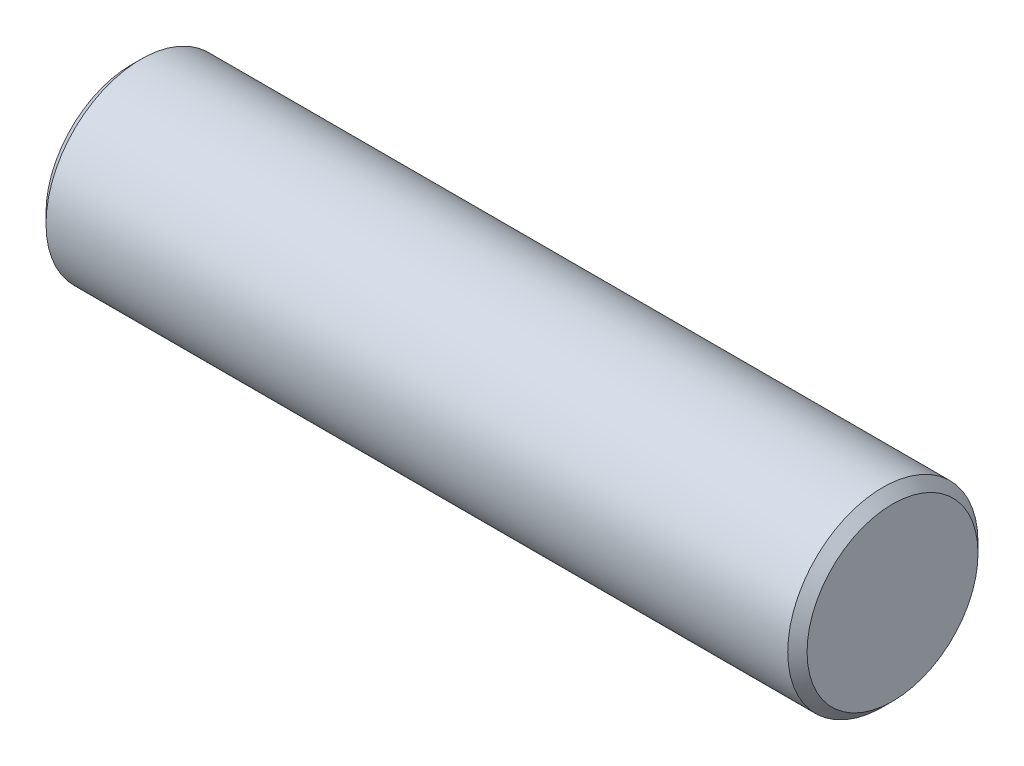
from build123d import *

# Parameters (mm, degrees)
XSECTION_R      = 2.5
EXTRUSION_DEPTH = 10
CHAMFER1_SIZE   = 0.254


with BuildPart() as part:
    # xsection → extrusion (new, symmetric)
    with BuildSketch(Plane(origin=(0, 0, 0), x_dir=(0, 0, -1), z_dir=(1, 0, 0))):
        Circle(XSECTION_R)
    extrude(amount=EXTRUSION_DEPTH, both=True)

    # Chamfer1
    chamfer1_edges = [part.edges().sort_by_distance(p)[0] for p in [
        (-10, 0, 2.5),
        (10, 0, 2.5),
    ]]
    chamfer(chamfer1_edges, length=CHAMFER1_SIZE)


solid = part.part
